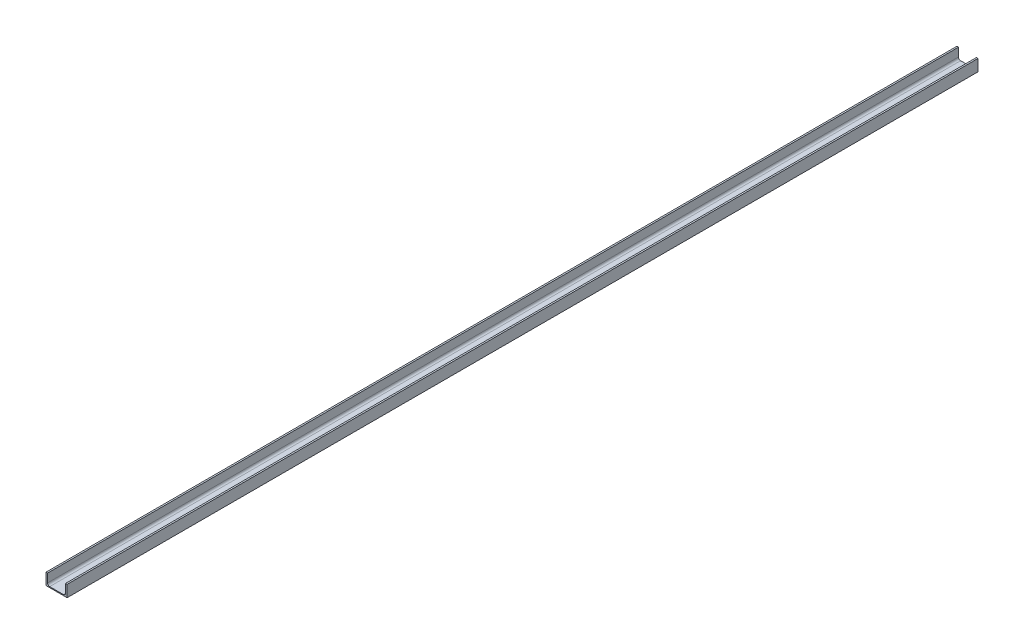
ISO-10303-21;
HEADER;
FILE_DESCRIPTION(('STEP AP214'),'2;1');
FILE_NAME('part.step','',(''),(''),'','','');
FILE_SCHEMA(('AUTOMOTIVE_DESIGN { 1 0 10303 214 1 1 1 1 }'));
ENDSEC;
DATA;
#1=APPLICATION_CONTEXT('core data for automotive mechanical design processes');
#2=APPLICATION_PROTOCOL_DEFINITION('international standard','automotive_design',2000,#1);
#3=PRODUCT_CONTEXT('',#1,'mechanical');
#4=PRODUCT('Part','Part','',(#3));
#5=PRODUCT_RELATED_PRODUCT_CATEGORY('part','',(#4));
#6=PRODUCT_DEFINITION_FORMATION('','',#4);
#7=PRODUCT_DEFINITION_CONTEXT('part definition',#1,'design');
#8=PRODUCT_DEFINITION('design','',#6,#7);
#9=PRODUCT_DEFINITION_SHAPE('','',#8);
#10=(LENGTH_UNIT() NAMED_UNIT(*) SI_UNIT(.MILLI.,.METRE.));
#11=(NAMED_UNIT(*) PLANE_ANGLE_UNIT() SI_UNIT($,.RADIAN.));
#12=(NAMED_UNIT(*) SI_UNIT($,.STERADIAN.) SOLID_ANGLE_UNIT());
#13=UNCERTAINTY_MEASURE_WITH_UNIT(LENGTH_MEASURE(1.E-05),#10,'distance_accuracy_value','');
#14=(GEOMETRIC_REPRESENTATION_CONTEXT(3) GLOBAL_UNCERTAINTY_ASSIGNED_CONTEXT((#13)) GLOBAL_UNIT_ASSIGNED_CONTEXT((#10,
#11,#12)) REPRESENTATION_CONTEXT('',''));
#15=CARTESIAN_POINT('',(0.,0.,0.));
#16=DIRECTION('',(0.,0.,1.));
#17=DIRECTION('',(1.,0.,0.));
#18=AXIS2_PLACEMENT_3D('',#15,#16,#17);
#19=CARTESIAN_POINT('',(0.,0.,4317.));
#20=DIRECTION('',(0.,1.,0.));
#21=DIRECTION('',(0.,0.,1.));
#22=AXIS2_PLACEMENT_3D('',#19,#20,#21);
#23=PLANE('',#22);
#24=CARTESIAN_POINT('',(49.9999999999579,0.,114.999999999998));
#25=DIRECTION('',(0.,1.,0.));
#26=DIRECTION('',(0.,0.,1.));
#27=AXIS2_PLACEMENT_3D('',#24,#25,#26);
#28=CIRCLE('',#27,7.50000000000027);
#29=CARTESIAN_POINT('',(49.9999999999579,0.,122.499999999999));
#30=VERTEX_POINT('',#29);
#31=EDGE_CURVE('E236',#30,#30,#28,.T.);
#32=ORIENTED_EDGE('',*,*,#31,.T.);
#33=EDGE_LOOP('',(#32));
#34=FACE_BOUND('',#33,.T.);
#35=CARTESIAN_POINT('',(49.9999999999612,0.,423.999999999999));
#36=DIRECTION('',(0.,1.,0.));
#37=DIRECTION('',(0.,0.,1.));
#38=AXIS2_PLACEMENT_3D('',#35,#36,#37);
#39=CIRCLE('',#38,7.50000000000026);
#40=CARTESIAN_POINT('',(49.9999999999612,0.,431.499999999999));
#41=VERTEX_POINT('',#40);
#42=EDGE_CURVE('E240',#41,#41,#39,.T.);
#43=ORIENTED_EDGE('',*,*,#42,.T.);
#44=EDGE_LOOP('',(#43));
#45=FACE_BOUND('',#44,.T.);
#46=CARTESIAN_POINT('',(49.9999999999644,0.,732.999999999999));
#47=DIRECTION('',(0.,1.,0.));
#48=DIRECTION('',(0.,0.,1.));
#49=AXIS2_PLACEMENT_3D('',#46,#47,#48);
#50=CIRCLE('',#49,7.50000000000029);
#51=CARTESIAN_POINT('',(49.9999999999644,0.,740.499999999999));
#52=VERTEX_POINT('',#51);
#53=EDGE_CURVE('E244',#52,#52,#50,.T.);
#54=ORIENTED_EDGE('',*,*,#53,.T.);
#55=EDGE_LOOP('',(#54));
#56=FACE_BOUND('',#55,.T.);
#57=CARTESIAN_POINT('',(49.9999999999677,0.,1042.));
#58=DIRECTION('',(0.,1.,0.));
#59=DIRECTION('',(0.,0.,1.));
#60=AXIS2_PLACEMENT_3D('',#57,#58,#59);
#61=CIRCLE('',#60,7.50000000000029);
#62=CARTESIAN_POINT('',(49.9999999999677,0.,1049.5));
#63=VERTEX_POINT('',#62);
#64=EDGE_CURVE('E248',#63,#63,#61,.T.);
#65=ORIENTED_EDGE('',*,*,#64,.T.);
#66=EDGE_LOOP('',(#65));
#67=FACE_BOUND('',#66,.T.);
#68=CARTESIAN_POINT('',(49.9999999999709,0.,1351.));
#69=DIRECTION('',(0.,1.,0.));
#70=DIRECTION('',(0.,0.,1.));
#71=AXIS2_PLACEMENT_3D('',#68,#69,#70);
#72=CIRCLE('',#71,7.50000000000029);
#73=CARTESIAN_POINT('',(49.9999999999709,0.,1358.5));
#74=VERTEX_POINT('',#73);
#75=EDGE_CURVE('E252',#74,#74,#72,.T.);
#76=ORIENTED_EDGE('',*,*,#75,.T.);
#77=EDGE_LOOP('',(#76));
#78=FACE_BOUND('',#77,.T.);
#79=CARTESIAN_POINT('',(49.9999999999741,0.,1660.));
#80=DIRECTION('',(0.,1.,0.));
#81=DIRECTION('',(0.,0.,1.));
#82=AXIS2_PLACEMENT_3D('',#79,#80,#81);
#83=CIRCLE('',#82,7.50000000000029);
#84=CARTESIAN_POINT('',(49.9999999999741,0.,1667.5));
#85=VERTEX_POINT('',#84);
#86=EDGE_CURVE('E256',#85,#85,#83,.T.);
#87=ORIENTED_EDGE('',*,*,#86,.T.);
#88=EDGE_LOOP('',(#87));
#89=FACE_BOUND('',#88,.T.);
#90=CARTESIAN_POINT('',(49.9999999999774,0.,1969.));
#91=DIRECTION('',(0.,1.,0.));
#92=DIRECTION('',(0.,0.,1.));
#93=AXIS2_PLACEMENT_3D('',#90,#91,#92);
#94=CIRCLE('',#93,7.50000000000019);
#95=CARTESIAN_POINT('',(49.9999999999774,0.,1976.5));
#96=VERTEX_POINT('',#95);
#97=EDGE_CURVE('E260',#96,#96,#94,.T.);
#98=ORIENTED_EDGE('',*,*,#97,.T.);
#99=EDGE_LOOP('',(#98));
#100=FACE_BOUND('',#99,.T.);
#101=CARTESIAN_POINT('',(49.9999999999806,0.,2278.));
#102=DIRECTION('',(0.,1.,0.));
#103=DIRECTION('',(0.,0.,1.));
#104=AXIS2_PLACEMENT_3D('',#101,#102,#103);
#105=CIRCLE('',#104,7.50000000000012);
#106=CARTESIAN_POINT('',(49.9999999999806,0.,2285.5));
#107=VERTEX_POINT('',#106);
#108=EDGE_CURVE('E264',#107,#107,#105,.T.);
#109=ORIENTED_EDGE('',*,*,#108,.T.);
#110=EDGE_LOOP('',(#109));
#111=FACE_BOUND('',#110,.T.);
#112=CARTESIAN_POINT('',(49.9999999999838,0.,2587.));
#113=DIRECTION('',(0.,1.,0.));
#114=DIRECTION('',(0.,0.,1.));
#115=AXIS2_PLACEMENT_3D('',#112,#113,#114);
#116=CIRCLE('',#115,7.50000000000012);
#117=CARTESIAN_POINT('',(49.9999999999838,0.,2594.5));
#118=VERTEX_POINT('',#117);
#119=EDGE_CURVE('E268',#118,#118,#116,.T.);
#120=ORIENTED_EDGE('',*,*,#119,.T.);
#121=EDGE_LOOP('',(#120));
#122=FACE_BOUND('',#121,.T.);
#123=CARTESIAN_POINT('',(49.9999999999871,0.,2896.));
#124=DIRECTION('',(0.,1.,0.));
#125=DIRECTION('',(0.,0.,1.));
#126=AXIS2_PLACEMENT_3D('',#123,#124,#125);
#127=CIRCLE('',#126,7.50000000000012);
#128=CARTESIAN_POINT('',(49.9999999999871,0.,2903.5));
#129=VERTEX_POINT('',#128);
#130=EDGE_CURVE('E272',#129,#129,#127,.T.);
#131=ORIENTED_EDGE('',*,*,#130,.T.);
#132=EDGE_LOOP('',(#131));
#133=FACE_BOUND('',#132,.T.);
#134=CARTESIAN_POINT('',(49.9999999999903,0.,3205.));
#135=DIRECTION('',(0.,1.,0.));
#136=DIRECTION('',(0.,0.,1.));
#137=AXIS2_PLACEMENT_3D('',#134,#135,#136);
#138=CIRCLE('',#137,7.50000000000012);
#139=CARTESIAN_POINT('',(49.9999999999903,0.,3212.5));
#140=VERTEX_POINT('',#139);
#141=EDGE_CURVE('E276',#140,#140,#138,.T.);
#142=ORIENTED_EDGE('',*,*,#141,.T.);
#143=EDGE_LOOP('',(#142));
#144=FACE_BOUND('',#143,.T.);
#145=CARTESIAN_POINT('',(49.9999999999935,0.,3514.));
#146=DIRECTION('',(0.,1.,0.));
#147=DIRECTION('',(0.,0.,1.));
#148=AXIS2_PLACEMENT_3D('',#145,#146,#147);
#149=CIRCLE('',#148,7.50000000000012);
#150=CARTESIAN_POINT('',(49.9999999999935,0.,3521.5));
#151=VERTEX_POINT('',#150);
#152=EDGE_CURVE('E280',#151,#151,#149,.T.);
#153=ORIENTED_EDGE('',*,*,#152,.T.);
#154=EDGE_LOOP('',(#153));
#155=FACE_BOUND('',#154,.T.);
#156=CARTESIAN_POINT('',(49.9999999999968,0.,3823.));
#157=DIRECTION('',(0.,1.,0.));
#158=DIRECTION('',(0.,0.,1.));
#159=AXIS2_PLACEMENT_3D('',#156,#157,#158);
#160=CIRCLE('',#159,7.50000000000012);
#161=CARTESIAN_POINT('',(49.9999999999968,0.,3830.5));
#162=VERTEX_POINT('',#161);
#163=EDGE_CURVE('E284',#162,#162,#160,.T.);
#164=ORIENTED_EDGE('',*,*,#163,.T.);
#165=EDGE_LOOP('',(#164));
#166=FACE_BOUND('',#165,.T.);
#167=CARTESIAN_POINT('',(50.,0.,4227.));
#168=DIRECTION('',(0.,1.,0.));
#169=DIRECTION('',(0.,0.,1.));
#170=AXIS2_PLACEMENT_3D('',#167,#168,#169);
#171=CIRCLE('',#170,7.50000000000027);
#172=CARTESIAN_POINT('',(50.,0.,4234.5));
#173=VERTEX_POINT('',#172);
#174=EDGE_CURVE('E288',#173,#173,#171,.T.);
#175=ORIENTED_EDGE('',*,*,#174,.T.);
#176=EDGE_LOOP('',(#175));
#177=FACE_BOUND('',#176,.T.);
#178=CARTESIAN_POINT('',(50.,0.,4132.));
#179=DIRECTION('',(0.,1.,0.));
#180=DIRECTION('',(0.,0.,1.));
#181=AXIS2_PLACEMENT_3D('',#178,#179,#180);
#182=CIRCLE('',#181,7.50000000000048);
#183=CARTESIAN_POINT('',(50.,0.,4139.5));
#184=VERTEX_POINT('',#183);
#185=EDGE_CURVE('E126',#184,#184,#182,.T.);
#186=ORIENTED_EDGE('',*,*,#185,.T.);
#187=EDGE_LOOP('',(#186));
#188=FACE_BOUND('',#187,.T.);
#189=DIRECTION('',(1.,0.,0.));
#190=VECTOR('',#189,1.);
#191=CARTESIAN_POINT('',(0.,0.,0.));
#192=LINE('',#191,#190);
#193=CARTESIAN_POINT('',(0.,0.,0.));
#194=VERTEX_POINT('',#193);
#195=CARTESIAN_POINT('',(100.,0.,0.));
#196=VERTEX_POINT('',#195);
#197=EDGE_CURVE('E114',#194,#196,#192,.T.);
#198=ORIENTED_EDGE('',*,*,#197,.T.);
#199=DIRECTION('',(0.,0.,-1.));
#200=VECTOR('',#199,1.);
#201=CARTESIAN_POINT('',(100.,0.,4317.));
#202=LINE('',#201,#200);
#203=CARTESIAN_POINT('',(100.,0.,4317.));
#204=VERTEX_POINT('',#203);
#205=EDGE_CURVE('E11',#204,#196,#202,.T.);
#206=ORIENTED_EDGE('',*,*,#205,.F.);
#207=DIRECTION('',(1.,0.,0.));
#208=VECTOR('',#207,1.);
#209=CARTESIAN_POINT('',(0.,0.,4317.));
#210=LINE('',#209,#208);
#211=CARTESIAN_POINT('',(0.,0.,4317.));
#212=VERTEX_POINT('',#211);
#213=EDGE_CURVE('E150',#212,#204,#210,.T.);
#214=ORIENTED_EDGE('',*,*,#213,.F.);
#215=DIRECTION('',(0.,0.,-1.));
#216=VECTOR('',#215,1.);
#217=CARTESIAN_POINT('',(0.,0.,4317.));
#218=LINE('',#217,#216);
#219=EDGE_CURVE('E46',#212,#194,#218,.T.);
#220=ORIENTED_EDGE('',*,*,#219,.T.);
#221=EDGE_LOOP('',(#198,#206,#214,#220));
#222=FACE_BOUND('',#221,.T.);
#223=ADVANCED_FACE('F32',(#34,#45,#56,#67,#78,#89,#100,#111,#122,#133,#144,#155,#166,#177,#188,
#222),#23,.F.);
#224=CARTESIAN_POINT('',(100.,0.,4317.));
#225=DIRECTION('',(-1.,0.,0.));
#226=DIRECTION('',(0.,0.,1.));
#227=AXIS2_PLACEMENT_3D('',#224,#225,#226);
#228=PLANE('',#227);
#229=DIRECTION('',(0.,1.,0.));
#230=VECTOR('',#229,1.);
#231=CARTESIAN_POINT('',(100.,0.,0.));
#232=LINE('',#231,#230);
#233=CARTESIAN_POINT('',(100.,55.,0.));
#234=VERTEX_POINT('',#233);
#235=EDGE_CURVE('E110',#196,#234,#232,.T.);
#236=ORIENTED_EDGE('',*,*,#235,.T.);
#237=DIRECTION('',(0.,0.,-1.));
#238=VECTOR('',#237,1.);
#239=CARTESIAN_POINT('',(100.,55.,4317.));
#240=LINE('',#239,#238);
#241=CARTESIAN_POINT('',(100.,55.,4317.));
#242=VERTEX_POINT('',#241);
#243=EDGE_CURVE('E39',#242,#234,#240,.T.);
#244=ORIENTED_EDGE('',*,*,#243,.F.);
#245=DIRECTION('',(0.,1.,0.));
#246=VECTOR('',#245,1.);
#247=CARTESIAN_POINT('',(100.,0.,4317.));
#248=LINE('',#247,#246);
#249=EDGE_CURVE('E123',#204,#242,#248,.T.);
#250=ORIENTED_EDGE('',*,*,#249,.F.);
#251=ORIENTED_EDGE('',*,*,#205,.T.);
#252=EDGE_LOOP('',(#236,#244,#250,#251));
#253=FACE_BOUND('',#252,.T.);
#254=ADVANCED_FACE('F122',(#253),#228,.F.);
#255=CARTESIAN_POINT('',(100.,55.,4317.));
#256=DIRECTION('',(0.,-1.,0.));
#257=DIRECTION('',(0.,0.,-1.));
#258=AXIS2_PLACEMENT_3D('',#255,#256,#257);
#259=PLANE('',#258);
#260=DIRECTION('',(-1.,0.,0.));
#261=VECTOR('',#260,1.);
#262=CARTESIAN_POINT('',(100.,55.,0.));
#263=LINE('',#262,#261);
#264=CARTESIAN_POINT('',(92.5,55.,0.));
#265=VERTEX_POINT('',#264);
#266=EDGE_CURVE('E116',#234,#265,#263,.T.);
#267=ORIENTED_EDGE('',*,*,#266,.T.);
#268=DIRECTION('',(0.,0.,-1.));
#269=VECTOR('',#268,1.);
#270=CARTESIAN_POINT('',(92.5,55.,4317.));
#271=LINE('',#270,#269);
#272=CARTESIAN_POINT('',(92.5,55.,4317.));
#273=VERTEX_POINT('',#272);
#274=EDGE_CURVE('E185',#273,#265,#271,.T.);
#275=ORIENTED_EDGE('',*,*,#274,.F.);
#276=DIRECTION('',(-1.,0.,0.));
#277=VECTOR('',#276,1.);
#278=CARTESIAN_POINT('',(100.,55.,4317.));
#279=LINE('',#278,#277);
#280=EDGE_CURVE('E153',#242,#273,#279,.T.);
#281=ORIENTED_EDGE('',*,*,#280,.F.);
#282=ORIENTED_EDGE('',*,*,#243,.T.);
#283=EDGE_LOOP('',(#267,#275,#281,#282));
#284=FACE_BOUND('',#283,.T.);
#285=ADVANCED_FACE('F189',(#284),#259,.F.);
#286=CARTESIAN_POINT('',(92.5,55.,4317.));
#287=DIRECTION('',(1.,0.,0.));
#288=DIRECTION('',(0.,0.,-1.));
#289=AXIS2_PLACEMENT_3D('',#286,#287,#288);
#290=PLANE('',#289);
#291=DIRECTION('',(0.,-1.,0.));
#292=VECTOR('',#291,1.);
#293=CARTESIAN_POINT('',(92.5,55.,0.));
#294=LINE('',#293,#292);
#295=CARTESIAN_POINT('',(92.5,14.5000000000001,0.));
#296=VERTEX_POINT('',#295);
#297=EDGE_CURVE('E134',#265,#296,#294,.T.);
#298=ORIENTED_EDGE('',*,*,#297,.T.);
#299=DIRECTION('',(0.,0.,-1.));
#300=VECTOR('',#299,1.);
#301=CARTESIAN_POINT('',(92.5,14.5000000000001,4317.));
#302=LINE('',#301,#300);
#303=CARTESIAN_POINT('',(92.5,14.5000000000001,4317.));
#304=VERTEX_POINT('',#303);
#305=EDGE_CURVE('E182',#304,#296,#302,.T.);
#306=ORIENTED_EDGE('',*,*,#305,.F.);
#307=DIRECTION('',(0.,-1.,0.));
#308=VECTOR('',#307,1.);
#309=CARTESIAN_POINT('',(92.5,55.,4317.));
#310=LINE('',#309,#308);
#311=EDGE_CURVE('E155',#273,#304,#310,.T.);
#312=ORIENTED_EDGE('',*,*,#311,.F.);
#313=ORIENTED_EDGE('',*,*,#274,.T.);
#314=EDGE_LOOP('',(#298,#306,#312,#313));
#315=FACE_BOUND('',#314,.T.);
#316=ADVANCED_FACE('F219',(#315),#290,.F.);
#317=CARTESIAN_POINT('',(82.5,14.5,4317.));
#318=DIRECTION('',(0.,0.,-1.));
#319=DIRECTION('',(-1.,0.,0.));
#320=AXIS2_PLACEMENT_3D('',#317,#318,#319);
#321=CYLINDRICAL_SURFACE('',#320,10.);
#322=CARTESIAN_POINT('',(82.5,14.5,0.));
#323=DIRECTION('',(0.,0.,-1.));
#324=DIRECTION('',(-1.,0.,0.));
#325=AXIS2_PLACEMENT_3D('',#322,#323,#324);
#326=CIRCLE('',#325,10.);
#327=CARTESIAN_POINT('',(82.4999999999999,4.5,0.));
#328=VERTEX_POINT('',#327);
#329=EDGE_CURVE('E136',#296,#328,#326,.T.);
#330=ORIENTED_EDGE('',*,*,#329,.T.);
#331=DIRECTION('',(0.,0.,-1.));
#332=VECTOR('',#331,1.);
#333=CARTESIAN_POINT('',(82.4999999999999,4.5,4317.));
#334=LINE('',#333,#332);
#335=CARTESIAN_POINT('',(82.4999999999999,4.5,4317.));
#336=VERTEX_POINT('',#335);
#337=EDGE_CURVE('E179',#336,#328,#334,.T.);
#338=ORIENTED_EDGE('',*,*,#337,.F.);
#339=CARTESIAN_POINT('',(82.5,14.5,4317.));
#340=DIRECTION('',(0.,0.,-1.));
#341=DIRECTION('',(-1.,0.,0.));
#342=AXIS2_PLACEMENT_3D('',#339,#340,#341);
#343=CIRCLE('',#342,10.);
#344=EDGE_CURVE('E157',#304,#336,#343,.T.);
#345=ORIENTED_EDGE('',*,*,#344,.F.);
#346=ORIENTED_EDGE('',*,*,#305,.T.);
#347=EDGE_LOOP('',(#330,#338,#345,#346));
#348=FACE_BOUND('',#347,.T.);
#349=ADVANCED_FACE('F216',(#348),#321,.F.);
#350=CARTESIAN_POINT('',(82.4999999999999,4.5,4317.));
#351=DIRECTION('',(0.,-1.,0.));
#352=DIRECTION('',(1.,0.,0.));
#353=AXIS2_PLACEMENT_3D('',#350,#351,#352);
#354=PLANE('',#353);
#355=CARTESIAN_POINT('',(49.9999999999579,4.49999999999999,114.999999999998));
#356=DIRECTION('',(0.,1.,0.));
#357=DIRECTION('',(-1.,0.,0.));
#358=AXIS2_PLACEMENT_3D('',#355,#356,#357);
#359=CIRCLE('',#358,7.50000000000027);
#360=CARTESIAN_POINT('',(42.4999999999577,4.49999999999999,114.999999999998));
#361=VERTEX_POINT('',#360);
#362=EDGE_CURVE('E324',#361,#361,#359,.T.);
#363=ORIENTED_EDGE('',*,*,#362,.F.);
#364=EDGE_LOOP('',(#363));
#365=FACE_BOUND('',#364,.T.);
#366=CARTESIAN_POINT('',(49.9999999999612,4.49999999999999,423.999999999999));
#367=DIRECTION('',(0.,1.,0.));
#368=DIRECTION('',(-1.,0.,0.));
#369=AXIS2_PLACEMENT_3D('',#366,#367,#368);
#370=CIRCLE('',#369,7.50000000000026);
#371=CARTESIAN_POINT('',(42.4999999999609,4.49999999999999,423.999999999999));
#372=VERTEX_POINT('',#371);
#373=EDGE_CURVE('E328',#372,#372,#370,.T.);
#374=ORIENTED_EDGE('',*,*,#373,.F.);
#375=EDGE_LOOP('',(#374));
#376=FACE_BOUND('',#375,.T.);
#377=CARTESIAN_POINT('',(49.9999999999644,4.49999999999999,732.999999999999));
#378=DIRECTION('',(0.,1.,0.));
#379=DIRECTION('',(-1.,0.,0.));
#380=AXIS2_PLACEMENT_3D('',#377,#378,#379);
#381=CIRCLE('',#380,7.50000000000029);
#382=CARTESIAN_POINT('',(42.4999999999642,4.49999999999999,732.999999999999));
#383=VERTEX_POINT('',#382);
#384=EDGE_CURVE('E332',#383,#383,#381,.T.);
#385=ORIENTED_EDGE('',*,*,#384,.F.);
#386=EDGE_LOOP('',(#385));
#387=FACE_BOUND('',#386,.T.);
#388=CARTESIAN_POINT('',(49.9999999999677,4.49999999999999,1042.));
#389=DIRECTION('',(0.,1.,0.));
#390=DIRECTION('',(-1.,0.,0.));
#391=AXIS2_PLACEMENT_3D('',#388,#389,#390);
#392=CIRCLE('',#391,7.50000000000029);
#393=CARTESIAN_POINT('',(42.4999999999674,4.49999999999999,1042.));
#394=VERTEX_POINT('',#393);
#395=EDGE_CURVE('E336',#394,#394,#392,.T.);
#396=ORIENTED_EDGE('',*,*,#395,.F.);
#397=EDGE_LOOP('',(#396));
#398=FACE_BOUND('',#397,.T.);
#399=CARTESIAN_POINT('',(49.9999999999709,4.49999999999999,1351.));
#400=DIRECTION('',(0.,1.,0.));
#401=DIRECTION('',(-1.,0.,0.));
#402=AXIS2_PLACEMENT_3D('',#399,#400,#401);
#403=CIRCLE('',#402,7.50000000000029);
#404=CARTESIAN_POINT('',(42.4999999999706,4.49999999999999,1351.));
#405=VERTEX_POINT('',#404);
#406=EDGE_CURVE('E340',#405,#405,#403,.T.);
#407=ORIENTED_EDGE('',*,*,#406,.F.);
#408=EDGE_LOOP('',(#407));
#409=FACE_BOUND('',#408,.T.);
#410=CARTESIAN_POINT('',(49.9999999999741,4.49999999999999,1660.));
#411=DIRECTION('',(0.,1.,0.));
#412=DIRECTION('',(-1.,0.,0.));
#413=AXIS2_PLACEMENT_3D('',#410,#411,#412);
#414=CIRCLE('',#413,7.50000000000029);
#415=CARTESIAN_POINT('',(42.4999999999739,4.49999999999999,1660.));
#416=VERTEX_POINT('',#415);
#417=EDGE_CURVE('E344',#416,#416,#414,.T.);
#418=ORIENTED_EDGE('',*,*,#417,.F.);
#419=EDGE_LOOP('',(#418));
#420=FACE_BOUND('',#419,.T.);
#421=CARTESIAN_POINT('',(49.9999999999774,4.49999999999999,1969.));
#422=DIRECTION('',(0.,1.,0.));
#423=DIRECTION('',(-1.,0.,0.));
#424=AXIS2_PLACEMENT_3D('',#421,#422,#423);
#425=CIRCLE('',#424,7.50000000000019);
#426=CARTESIAN_POINT('',(42.4999999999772,4.49999999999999,1969.));
#427=VERTEX_POINT('',#426);
#428=EDGE_CURVE('E348',#427,#427,#425,.T.);
#429=ORIENTED_EDGE('',*,*,#428,.F.);
#430=EDGE_LOOP('',(#429));
#431=FACE_BOUND('',#430,.T.);
#432=CARTESIAN_POINT('',(49.9999999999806,4.49999999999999,2278.));
#433=DIRECTION('',(0.,1.,0.));
#434=DIRECTION('',(-1.,0.,0.));
#435=AXIS2_PLACEMENT_3D('',#432,#433,#434);
#436=CIRCLE('',#435,7.50000000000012);
#437=CARTESIAN_POINT('',(42.4999999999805,4.49999999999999,2278.));
#438=VERTEX_POINT('',#437);
#439=EDGE_CURVE('E352',#438,#438,#436,.T.);
#440=ORIENTED_EDGE('',*,*,#439,.F.);
#441=EDGE_LOOP('',(#440));
#442=FACE_BOUND('',#441,.T.);
#443=CARTESIAN_POINT('',(49.9999999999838,4.49999999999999,2587.));
#444=DIRECTION('',(0.,1.,0.));
#445=DIRECTION('',(-1.,0.,0.));
#446=AXIS2_PLACEMENT_3D('',#443,#444,#445);
#447=CIRCLE('',#446,7.50000000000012);
#448=CARTESIAN_POINT('',(42.4999999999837,4.49999999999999,2587.));
#449=VERTEX_POINT('',#448);
#450=EDGE_CURVE('E356',#449,#449,#447,.T.);
#451=ORIENTED_EDGE('',*,*,#450,.F.);
#452=EDGE_LOOP('',(#451));
#453=FACE_BOUND('',#452,.T.);
#454=CARTESIAN_POINT('',(49.9999999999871,4.49999999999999,2896.));
#455=DIRECTION('',(0.,1.,0.));
#456=DIRECTION('',(-1.,0.,0.));
#457=AXIS2_PLACEMENT_3D('',#454,#455,#456);
#458=CIRCLE('',#457,7.50000000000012);
#459=CARTESIAN_POINT('',(42.499999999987,4.49999999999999,2896.));
#460=VERTEX_POINT('',#459);
#461=EDGE_CURVE('E360',#460,#460,#458,.T.);
#462=ORIENTED_EDGE('',*,*,#461,.F.);
#463=EDGE_LOOP('',(#462));
#464=FACE_BOUND('',#463,.T.);
#465=CARTESIAN_POINT('',(49.9999999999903,4.49999999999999,3205.));
#466=DIRECTION('',(0.,1.,0.));
#467=DIRECTION('',(-1.,0.,0.));
#468=AXIS2_PLACEMENT_3D('',#465,#466,#467);
#469=CIRCLE('',#468,7.50000000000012);
#470=CARTESIAN_POINT('',(42.4999999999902,4.49999999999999,3205.));
#471=VERTEX_POINT('',#470);
#472=EDGE_CURVE('E364',#471,#471,#469,.T.);
#473=ORIENTED_EDGE('',*,*,#472,.F.);
#474=EDGE_LOOP('',(#473));
#475=FACE_BOUND('',#474,.T.);
#476=CARTESIAN_POINT('',(49.9999999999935,4.49999999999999,3514.));
#477=DIRECTION('',(0.,1.,0.));
#478=DIRECTION('',(-1.,0.,0.));
#479=AXIS2_PLACEMENT_3D('',#476,#477,#478);
#480=CIRCLE('',#479,7.50000000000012);
#481=CARTESIAN_POINT('',(42.4999999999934,4.49999999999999,3514.));
#482=VERTEX_POINT('',#481);
#483=EDGE_CURVE('E368',#482,#482,#480,.T.);
#484=ORIENTED_EDGE('',*,*,#483,.F.);
#485=EDGE_LOOP('',(#484));
#486=FACE_BOUND('',#485,.T.);
#487=CARTESIAN_POINT('',(49.9999999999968,4.49999999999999,3823.));
#488=DIRECTION('',(0.,1.,0.));
#489=DIRECTION('',(-1.,0.,0.));
#490=AXIS2_PLACEMENT_3D('',#487,#488,#489);
#491=CIRCLE('',#490,7.50000000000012);
#492=CARTESIAN_POINT('',(42.4999999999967,4.49999999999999,3823.));
#493=VERTEX_POINT('',#492);
#494=EDGE_CURVE('E372',#493,#493,#491,.T.);
#495=ORIENTED_EDGE('',*,*,#494,.F.);
#496=EDGE_LOOP('',(#495));
#497=FACE_BOUND('',#496,.T.);
#498=CARTESIAN_POINT('',(50.,4.49999999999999,4227.));
#499=DIRECTION('',(0.,1.,0.));
#500=DIRECTION('',(-1.,0.,0.));
#501=AXIS2_PLACEMENT_3D('',#498,#499,#500);
#502=CIRCLE('',#501,7.50000000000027);
#503=CARTESIAN_POINT('',(42.4999999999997,4.49999999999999,4227.));
#504=VERTEX_POINT('',#503);
#505=EDGE_CURVE('E376',#504,#504,#502,.T.);
#506=ORIENTED_EDGE('',*,*,#505,.F.);
#507=EDGE_LOOP('',(#506));
#508=FACE_BOUND('',#507,.T.);
#509=CARTESIAN_POINT('',(50.,4.49999999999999,4132.));
#510=DIRECTION('',(0.,1.,0.));
#511=DIRECTION('',(-1.,0.,0.));
#512=AXIS2_PLACEMENT_3D('',#509,#510,#511);
#513=CIRCLE('',#512,7.50000000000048);
#514=CARTESIAN_POINT('',(42.4999999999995,4.49999999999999,4132.));
#515=VERTEX_POINT('',#514);
#516=EDGE_CURVE('E129',#515,#515,#513,.T.);
#517=ORIENTED_EDGE('',*,*,#516,.F.);
#518=EDGE_LOOP('',(#517));
#519=FACE_BOUND('',#518,.T.);
#520=DIRECTION('',(-1.,0.,0.));
#521=VECTOR('',#520,1.);
#522=CARTESIAN_POINT('',(82.4999999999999,4.5,0.));
#523=LINE('',#522,#521);
#524=CARTESIAN_POINT('',(17.5000000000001,4.49999999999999,0.));
#525=VERTEX_POINT('',#524);
#526=EDGE_CURVE('E138',#328,#525,#523,.T.);
#527=ORIENTED_EDGE('',*,*,#526,.T.);
#528=DIRECTION('',(0.,0.,-1.));
#529=VECTOR('',#528,1.);
#530=CARTESIAN_POINT('',(17.5000000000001,4.49999999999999,4317.));
#531=LINE('',#530,#529);
#532=CARTESIAN_POINT('',(17.5000000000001,4.49999999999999,4317.));
#533=VERTEX_POINT('',#532);
#534=EDGE_CURVE('E176',#533,#525,#531,.T.);
#535=ORIENTED_EDGE('',*,*,#534,.F.);
#536=DIRECTION('',(-1.,0.,0.));
#537=VECTOR('',#536,1.);
#538=CARTESIAN_POINT('',(82.4999999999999,4.5,4317.));
#539=LINE('',#538,#537);
#540=EDGE_CURVE('E159',#336,#533,#539,.T.);
#541=ORIENTED_EDGE('',*,*,#540,.F.);
#542=ORIENTED_EDGE('',*,*,#337,.T.);
#543=EDGE_LOOP('',(#527,#535,#541,#542));
#544=FACE_BOUND('',#543,.T.);
#545=ADVANCED_FACE('F212',(#365,#376,#387,#398,#409,#420,#431,#442,#453,#464,#475,#486,#497,
#508,#519,#544),#354,.F.);
#546=CARTESIAN_POINT('',(17.5,14.5,4317.));
#547=DIRECTION('',(0.,0.,-1.));
#548=DIRECTION('',(-1.,0.,0.));
#549=AXIS2_PLACEMENT_3D('',#546,#547,#548);
#550=CYLINDRICAL_SURFACE('',#549,10.);
#551=CARTESIAN_POINT('',(17.5,14.5,0.));
#552=DIRECTION('',(0.,0.,-1.));
#553=DIRECTION('',(-1.,0.,0.));
#554=AXIS2_PLACEMENT_3D('',#551,#552,#553);
#555=CIRCLE('',#554,10.);
#556=CARTESIAN_POINT('',(7.50000000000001,14.5000000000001,0.));
#557=VERTEX_POINT('',#556);
#558=EDGE_CURVE('E140',#525,#557,#555,.T.);
#559=ORIENTED_EDGE('',*,*,#558,.T.);
#560=DIRECTION('',(0.,0.,-1.));
#561=VECTOR('',#560,1.);
#562=CARTESIAN_POINT('',(7.50000000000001,14.5000000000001,4317.));
#563=LINE('',#562,#561);
#564=CARTESIAN_POINT('',(7.50000000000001,14.5000000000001,4317.));
#565=VERTEX_POINT('',#564);
#566=EDGE_CURVE('E173',#565,#557,#563,.T.);
#567=ORIENTED_EDGE('',*,*,#566,.F.);
#568=CARTESIAN_POINT('',(17.5,14.5,4317.));
#569=DIRECTION('',(0.,0.,-1.));
#570=DIRECTION('',(-1.,0.,0.));
#571=AXIS2_PLACEMENT_3D('',#568,#569,#570);
#572=CIRCLE('',#571,10.);
#573=EDGE_CURVE('E161',#533,#565,#572,.T.);
#574=ORIENTED_EDGE('',*,*,#573,.F.);
#575=ORIENTED_EDGE('',*,*,#534,.T.);
#576=EDGE_LOOP('',(#559,#567,#574,#575));
#577=FACE_BOUND('',#576,.T.);
#578=ADVANCED_FACE('F208',(#577),#550,.F.);
#579=CARTESIAN_POINT('',(7.50000000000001,14.5000000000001,4317.));
#580=DIRECTION('',(-1.,0.,0.));
#581=DIRECTION('',(0.,-1.,0.));
#582=AXIS2_PLACEMENT_3D('',#579,#580,#581);
#583=PLANE('',#582);
#584=DIRECTION('',(0.,1.,0.));
#585=VECTOR('',#584,1.);
#586=CARTESIAN_POINT('',(7.50000000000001,14.5000000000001,0.));
#587=LINE('',#586,#585);
#588=CARTESIAN_POINT('',(7.5,55.,0.));
#589=VERTEX_POINT('',#588);
#590=EDGE_CURVE('E142',#557,#589,#587,.T.);
#591=ORIENTED_EDGE('',*,*,#590,.T.);
#592=DIRECTION('',(0.,0.,-1.));
#593=VECTOR('',#592,1.);
#594=CARTESIAN_POINT('',(7.5,55.,4317.));
#595=LINE('',#594,#593);
#596=CARTESIAN_POINT('',(7.5,55.,4317.));
#597=VERTEX_POINT('',#596);
#598=EDGE_CURVE('E171',#597,#589,#595,.T.);
#599=ORIENTED_EDGE('',*,*,#598,.F.);
#600=DIRECTION('',(0.,1.,0.));
#601=VECTOR('',#600,1.);
#602=CARTESIAN_POINT('',(7.50000000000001,14.5000000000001,4317.));
#603=LINE('',#602,#601);
#604=EDGE_CURVE('E163',#565,#597,#603,.T.);
#605=ORIENTED_EDGE('',*,*,#604,.F.);
#606=ORIENTED_EDGE('',*,*,#566,.T.);
#607=EDGE_LOOP('',(#591,#599,#605,#606));
#608=FACE_BOUND('',#607,.T.);
#609=ADVANCED_FACE('F203',(#608),#583,.F.);
#610=CARTESIAN_POINT('',(0.,55.,4317.));
#611=DIRECTION('',(0.,1.,0.));
#612=DIRECTION('',(0.,0.,1.));
#613=AXIS2_PLACEMENT_3D('',#610,#611,#612);
#614=PLANE('',#613);
#615=DIRECTION('',(1.,0.,0.));
#616=VECTOR('',#615,1.);
#617=CARTESIAN_POINT('',(0.,55.,0.));
#618=LINE('',#617,#616);
#619=CARTESIAN_POINT('',(0.,55.,0.));
#620=VERTEX_POINT('',#619);
#621=EDGE_CURVE('E145',#620,#589,#618,.T.);
#622=ORIENTED_EDGE('',*,*,#621,.F.);
#623=DIRECTION('',(0.,0.,-1.));
#624=VECTOR('',#623,1.);
#625=CARTESIAN_POINT('',(0.,55.,4317.));
#626=LINE('',#625,#624);
#627=CARTESIAN_POINT('',(0.,55.,4317.));
#628=VERTEX_POINT('',#627);
#629=EDGE_CURVE('E54',#628,#620,#626,.T.);
#630=ORIENTED_EDGE('',*,*,#629,.F.);
#631=DIRECTION('',(1.,0.,0.));
#632=VECTOR('',#631,1.);
#633=CARTESIAN_POINT('',(0.,55.,4317.));
#634=LINE('',#633,#632);
#635=EDGE_CURVE('E165',#628,#597,#634,.T.);
#636=ORIENTED_EDGE('',*,*,#635,.T.);
#637=ORIENTED_EDGE('',*,*,#598,.T.);
#638=EDGE_LOOP('',(#622,#630,#636,#637));
#639=FACE_BOUND('',#638,.T.);
#640=ADVANCED_FACE('F197',(#639),#614,.T.);
#641=CARTESIAN_POINT('',(0.,0.,4317.));
#642=DIRECTION('',(-1.,0.,0.));
#643=DIRECTION('',(0.,0.,1.));
#644=AXIS2_PLACEMENT_3D('',#641,#642,#643);
#645=PLANE('',#644);
#646=DIRECTION('',(0.,1.,0.));
#647=VECTOR('',#646,1.);
#648=CARTESIAN_POINT('',(0.,0.,0.));
#649=LINE('',#648,#647);
#650=EDGE_CURVE('E148',#194,#620,#649,.T.);
#651=ORIENTED_EDGE('',*,*,#650,.F.);
#652=ORIENTED_EDGE('',*,*,#219,.F.);
#653=DIRECTION('',(0.,1.,0.));
#654=VECTOR('',#653,1.);
#655=CARTESIAN_POINT('',(0.,0.,4317.));
#656=LINE('',#655,#654);
#657=EDGE_CURVE('E167',#212,#628,#656,.T.);
#658=ORIENTED_EDGE('',*,*,#657,.T.);
#659=ORIENTED_EDGE('',*,*,#629,.T.);
#660=EDGE_LOOP('',(#651,#652,#658,#659));
#661=FACE_BOUND('',#660,.T.);
#662=ADVANCED_FACE('F196',(#661),#645,.T.);
#663=CARTESIAN_POINT('',(82.5,14.5,4317.));
#664=DIRECTION('',(0.,0.,-1.));
#665=DIRECTION('',(-1.,0.,0.));
#666=AXIS2_PLACEMENT_3D('',#663,#664,#665);
#667=PLANE('',#666);
#668=ORIENTED_EDGE('',*,*,#213,.T.);
#669=ORIENTED_EDGE('',*,*,#249,.T.);
#670=ORIENTED_EDGE('',*,*,#280,.T.);
#671=ORIENTED_EDGE('',*,*,#311,.T.);
#672=ORIENTED_EDGE('',*,*,#344,.T.);
#673=ORIENTED_EDGE('',*,*,#540,.T.);
#674=ORIENTED_EDGE('',*,*,#573,.T.);
#675=ORIENTED_EDGE('',*,*,#604,.T.);
#676=ORIENTED_EDGE('',*,*,#635,.F.);
#677=ORIENTED_EDGE('',*,*,#657,.F.);
#678=EDGE_LOOP('',(#668,#669,#670,#671,#672,#673,#674,#675,#676,#677));
#679=FACE_BOUND('',#678,.T.);
#680=ADVANCED_FACE('F193',(#679),#667,.F.);
#681=CARTESIAN_POINT('',(82.5,14.5,0.));
#682=DIRECTION('',(0.,0.,-1.));
#683=DIRECTION('',(-1.,0.,0.));
#684=AXIS2_PLACEMENT_3D('',#681,#682,#683);
#685=PLANE('',#684);
#686=ORIENTED_EDGE('',*,*,#197,.F.);
#687=ORIENTED_EDGE('',*,*,#650,.T.);
#688=ORIENTED_EDGE('',*,*,#621,.T.);
#689=ORIENTED_EDGE('',*,*,#590,.F.);
#690=ORIENTED_EDGE('',*,*,#558,.F.);
#691=ORIENTED_EDGE('',*,*,#526,.F.);
#692=ORIENTED_EDGE('',*,*,#329,.F.);
#693=ORIENTED_EDGE('',*,*,#297,.F.);
#694=ORIENTED_EDGE('',*,*,#266,.F.);
#695=ORIENTED_EDGE('',*,*,#235,.F.);
#696=EDGE_LOOP('',(#686,#687,#688,#689,#690,#691,#692,#693,#694,#695));
#697=FACE_BOUND('',#696,.T.);
#698=ADVANCED_FACE('F111',(#697),#685,.T.);
#699=CARTESIAN_POINT('',(50.,-5.50000000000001,4132.));
#700=DIRECTION('',(0.,1.,0.));
#701=DIRECTION('',(-1.,0.,0.));
#702=AXIS2_PLACEMENT_3D('',#699,#700,#701);
#703=CYLINDRICAL_SURFACE('',#702,7.50000000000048);
#704=ORIENTED_EDGE('',*,*,#516,.T.);
#705=EDGE_LOOP('',(#704));
#706=FACE_BOUND('',#705,.T.);
#707=ORIENTED_EDGE('',*,*,#185,.F.);
#708=EDGE_LOOP('',(#707));
#709=FACE_BOUND('',#708,.T.);
#710=ADVANCED_FACE('F291',(#706,#709),#703,.F.);
#711=CARTESIAN_POINT('',(50.,-5.50000000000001,4227.));
#712=DIRECTION('',(0.,1.,0.));
#713=DIRECTION('',(-1.,0.,0.));
#714=AXIS2_PLACEMENT_3D('',#711,#712,#713);
#715=CYLINDRICAL_SURFACE('',#714,7.50000000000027);
#716=ORIENTED_EDGE('',*,*,#505,.T.);
#717=EDGE_LOOP('',(#716));
#718=FACE_BOUND('',#717,.T.);
#719=ORIENTED_EDGE('',*,*,#174,.F.);
#720=EDGE_LOOP('',(#719));
#721=FACE_BOUND('',#720,.T.);
#722=ADVANCED_FACE('F293',(#718,#721),#715,.F.);
#723=CARTESIAN_POINT('',(49.9999999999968,-5.50000000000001,3823.));
#724=DIRECTION('',(0.,1.,0.));
#725=DIRECTION('',(-1.,0.,0.));
#726=AXIS2_PLACEMENT_3D('',#723,#724,#725);
#727=CYLINDRICAL_SURFACE('',#726,7.50000000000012);
#728=ORIENTED_EDGE('',*,*,#494,.T.);
#729=EDGE_LOOP('',(#728));
#730=FACE_BOUND('',#729,.T.);
#731=ORIENTED_EDGE('',*,*,#163,.F.);
#732=EDGE_LOOP('',(#731));
#733=FACE_BOUND('',#732,.T.);
#734=ADVANCED_FACE('F300',(#730,#733),#727,.F.);
#735=CARTESIAN_POINT('',(49.9999999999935,-5.50000000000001,3514.));
#736=DIRECTION('',(0.,1.,0.));
#737=DIRECTION('',(-1.,0.,0.));
#738=AXIS2_PLACEMENT_3D('',#735,#736,#737);
#739=CYLINDRICAL_SURFACE('',#738,7.50000000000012);
#740=ORIENTED_EDGE('',*,*,#483,.T.);
#741=EDGE_LOOP('',(#740));
#742=FACE_BOUND('',#741,.T.);
#743=ORIENTED_EDGE('',*,*,#152,.F.);
#744=EDGE_LOOP('',(#743));
#745=FACE_BOUND('',#744,.T.);
#746=ADVANCED_FACE('F453',(#742,#745),#739,.F.);
#747=CARTESIAN_POINT('',(49.9999999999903,-5.50000000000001,3205.));
#748=DIRECTION('',(0.,1.,0.));
#749=DIRECTION('',(-1.,0.,0.));
#750=AXIS2_PLACEMENT_3D('',#747,#748,#749);
#751=CYLINDRICAL_SURFACE('',#750,7.50000000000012);
#752=ORIENTED_EDGE('',*,*,#472,.T.);
#753=EDGE_LOOP('',(#752));
#754=FACE_BOUND('',#753,.T.);
#755=ORIENTED_EDGE('',*,*,#141,.F.);
#756=EDGE_LOOP('',(#755));
#757=FACE_BOUND('',#756,.T.);
#758=ADVANCED_FACE('F449',(#754,#757),#751,.F.);
#759=CARTESIAN_POINT('',(49.9999999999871,-5.50000000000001,2896.));
#760=DIRECTION('',(0.,1.,0.));
#761=DIRECTION('',(-1.,0.,0.));
#762=AXIS2_PLACEMENT_3D('',#759,#760,#761);
#763=CYLINDRICAL_SURFACE('',#762,7.50000000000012);
#764=ORIENTED_EDGE('',*,*,#461,.T.);
#765=EDGE_LOOP('',(#764));
#766=FACE_BOUND('',#765,.T.);
#767=ORIENTED_EDGE('',*,*,#130,.F.);
#768=EDGE_LOOP('',(#767));
#769=FACE_BOUND('',#768,.T.);
#770=ADVANCED_FACE('F445',(#766,#769),#763,.F.);
#771=CARTESIAN_POINT('',(49.9999999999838,-5.50000000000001,2587.));
#772=DIRECTION('',(0.,1.,0.));
#773=DIRECTION('',(-1.,0.,0.));
#774=AXIS2_PLACEMENT_3D('',#771,#772,#773);
#775=CYLINDRICAL_SURFACE('',#774,7.50000000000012);
#776=ORIENTED_EDGE('',*,*,#450,.T.);
#777=EDGE_LOOP('',(#776));
#778=FACE_BOUND('',#777,.T.);
#779=ORIENTED_EDGE('',*,*,#119,.F.);
#780=EDGE_LOOP('',(#779));
#781=FACE_BOUND('',#780,.T.);
#782=ADVANCED_FACE('F441',(#778,#781),#775,.F.);
#783=CARTESIAN_POINT('',(49.9999999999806,-5.50000000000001,2278.));
#784=DIRECTION('',(0.,1.,0.));
#785=DIRECTION('',(-1.,0.,0.));
#786=AXIS2_PLACEMENT_3D('',#783,#784,#785);
#787=CYLINDRICAL_SURFACE('',#786,7.50000000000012);
#788=ORIENTED_EDGE('',*,*,#439,.T.);
#789=EDGE_LOOP('',(#788));
#790=FACE_BOUND('',#789,.T.);
#791=ORIENTED_EDGE('',*,*,#108,.F.);
#792=EDGE_LOOP('',(#791));
#793=FACE_BOUND('',#792,.T.);
#794=ADVANCED_FACE('F437',(#790,#793),#787,.F.);
#795=CARTESIAN_POINT('',(49.9999999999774,-5.50000000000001,1969.));
#796=DIRECTION('',(0.,1.,0.));
#797=DIRECTION('',(-1.,0.,0.));
#798=AXIS2_PLACEMENT_3D('',#795,#796,#797);
#799=CYLINDRICAL_SURFACE('',#798,7.50000000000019);
#800=ORIENTED_EDGE('',*,*,#428,.T.);
#801=EDGE_LOOP('',(#800));
#802=FACE_BOUND('',#801,.T.);
#803=ORIENTED_EDGE('',*,*,#97,.F.);
#804=EDGE_LOOP('',(#803));
#805=FACE_BOUND('',#804,.T.);
#806=ADVANCED_FACE('F433',(#802,#805),#799,.F.);
#807=CARTESIAN_POINT('',(49.9999999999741,-5.50000000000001,1660.));
#808=DIRECTION('',(0.,1.,0.));
#809=DIRECTION('',(-1.,0.,0.));
#810=AXIS2_PLACEMENT_3D('',#807,#808,#809);
#811=CYLINDRICAL_SURFACE('',#810,7.50000000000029);
#812=ORIENTED_EDGE('',*,*,#417,.T.);
#813=EDGE_LOOP('',(#812));
#814=FACE_BOUND('',#813,.T.);
#815=ORIENTED_EDGE('',*,*,#86,.F.);
#816=EDGE_LOOP('',(#815));
#817=FACE_BOUND('',#816,.T.);
#818=ADVANCED_FACE('F429',(#814,#817),#811,.F.);
#819=CARTESIAN_POINT('',(49.9999999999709,-5.50000000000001,1351.));
#820=DIRECTION('',(0.,1.,0.));
#821=DIRECTION('',(-1.,0.,0.));
#822=AXIS2_PLACEMENT_3D('',#819,#820,#821);
#823=CYLINDRICAL_SURFACE('',#822,7.50000000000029);
#824=ORIENTED_EDGE('',*,*,#406,.T.);
#825=EDGE_LOOP('',(#824));
#826=FACE_BOUND('',#825,.T.);
#827=ORIENTED_EDGE('',*,*,#75,.F.);
#828=EDGE_LOOP('',(#827));
#829=FACE_BOUND('',#828,.T.);
#830=ADVANCED_FACE('F425',(#826,#829),#823,.F.);
#831=CARTESIAN_POINT('',(49.9999999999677,-5.50000000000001,1042.));
#832=DIRECTION('',(0.,1.,0.));
#833=DIRECTION('',(-1.,0.,0.));
#834=AXIS2_PLACEMENT_3D('',#831,#832,#833);
#835=CYLINDRICAL_SURFACE('',#834,7.50000000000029);
#836=ORIENTED_EDGE('',*,*,#395,.T.);
#837=EDGE_LOOP('',(#836));
#838=FACE_BOUND('',#837,.T.);
#839=ORIENTED_EDGE('',*,*,#64,.F.);
#840=EDGE_LOOP('',(#839));
#841=FACE_BOUND('',#840,.T.);
#842=ADVANCED_FACE('F421',(#838,#841),#835,.F.);
#843=CARTESIAN_POINT('',(49.9999999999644,-5.50000000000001,732.999999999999));
#844=DIRECTION('',(0.,1.,0.));
#845=DIRECTION('',(-1.,0.,0.));
#846=AXIS2_PLACEMENT_3D('',#843,#844,#845);
#847=CYLINDRICAL_SURFACE('',#846,7.50000000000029);
#848=ORIENTED_EDGE('',*,*,#384,.T.);
#849=EDGE_LOOP('',(#848));
#850=FACE_BOUND('',#849,.T.);
#851=ORIENTED_EDGE('',*,*,#53,.F.);
#852=EDGE_LOOP('',(#851));
#853=FACE_BOUND('',#852,.T.);
#854=ADVANCED_FACE('F415',(#850,#853),#847,.F.);
#855=CARTESIAN_POINT('',(49.9999999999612,-5.50000000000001,423.999999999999));
#856=DIRECTION('',(0.,1.,0.));
#857=DIRECTION('',(-1.,0.,0.));
#858=AXIS2_PLACEMENT_3D('',#855,#856,#857);
#859=CYLINDRICAL_SURFACE('',#858,7.50000000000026);
#860=ORIENTED_EDGE('',*,*,#373,.T.);
#861=EDGE_LOOP('',(#860));
#862=FACE_BOUND('',#861,.T.);
#863=ORIENTED_EDGE('',*,*,#42,.F.);
#864=EDGE_LOOP('',(#863));
#865=FACE_BOUND('',#864,.T.);
#866=ADVANCED_FACE('F410',(#862,#865),#859,.F.);
#867=CARTESIAN_POINT('',(49.9999999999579,-5.50000000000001,114.999999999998));
#868=DIRECTION('',(0.,1.,0.));
#869=DIRECTION('',(-1.,0.,0.));
#870=AXIS2_PLACEMENT_3D('',#867,#868,#869);
#871=CYLINDRICAL_SURFACE('',#870,7.50000000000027);
#872=ORIENTED_EDGE('',*,*,#362,.T.);
#873=EDGE_LOOP('',(#872));
#874=FACE_BOUND('',#873,.T.);
#875=ORIENTED_EDGE('',*,*,#31,.F.);
#876=EDGE_LOOP('',(#875));
#877=FACE_BOUND('',#876,.T.);
#878=ADVANCED_FACE('F407',(#874,#877),#871,.F.);
#879=CLOSED_SHELL('',(#223,#254,#285,#316,#349,#545,#578,#609,#640,#662,#680,#698,#710,#722,
#734,#746,#758,#770,#782,#794,#806,#818,#830,#842,#854,#866,#878));
#880=MANIFOLD_SOLID_BREP('B2',#879);
#881=ADVANCED_BREP_SHAPE_REPRESENTATION('',(#18,#880),#14);
#882=SHAPE_DEFINITION_REPRESENTATION(#9,#881);
ENDSEC;
END-ISO-10303-21;
